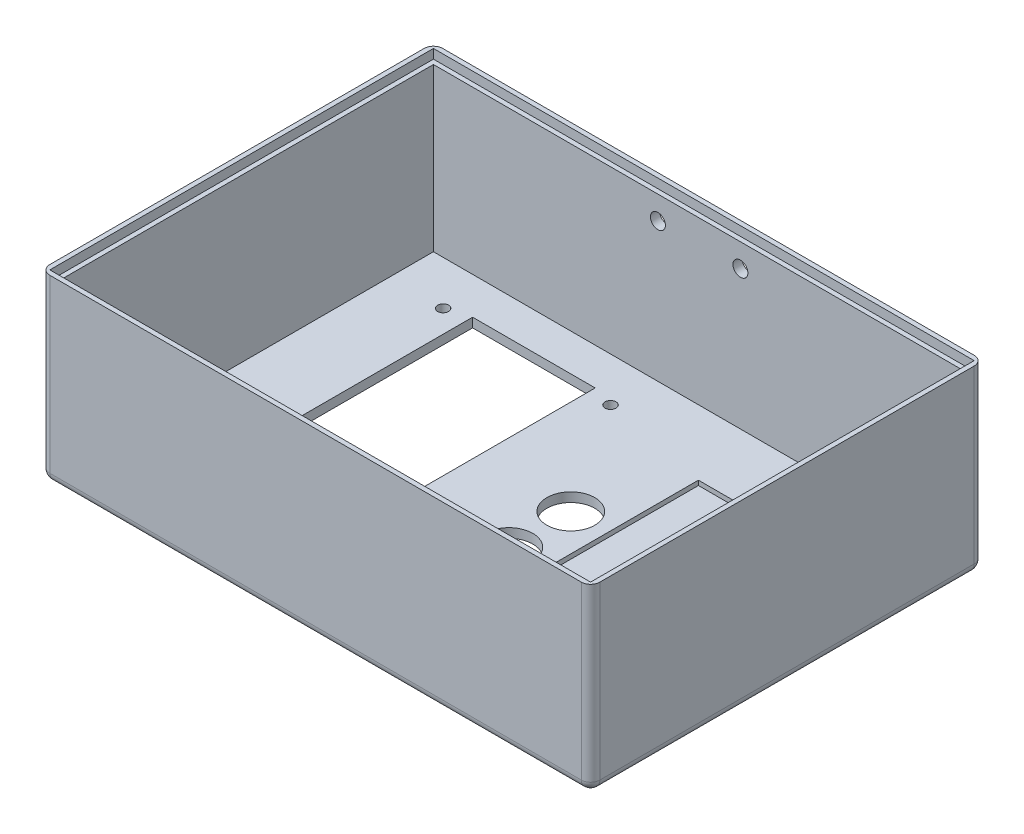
ISO-10303-21;
HEADER;
FILE_DESCRIPTION(('STEP AP214'),'2;1');
FILE_NAME('part.step','',(''),(''),'','','');
FILE_SCHEMA(('AUTOMOTIVE_DESIGN { 1 0 10303 214 1 1 1 1 }'));
ENDSEC;
DATA;
#1=APPLICATION_CONTEXT('core data for automotive mechanical design processes');
#2=APPLICATION_PROTOCOL_DEFINITION('international standard','automotive_design',2000,#1);
#3=PRODUCT_CONTEXT('',#1,'mechanical');
#4=PRODUCT('Part','Part','',(#3));
#5=PRODUCT_RELATED_PRODUCT_CATEGORY('part','',(#4));
#6=PRODUCT_DEFINITION_FORMATION('','',#4);
#7=PRODUCT_DEFINITION_CONTEXT('part definition',#1,'design');
#8=PRODUCT_DEFINITION('design','',#6,#7);
#9=PRODUCT_DEFINITION_SHAPE('','',#8);
#10=(LENGTH_UNIT() NAMED_UNIT(*) SI_UNIT(.MILLI.,.METRE.));
#11=(NAMED_UNIT(*) PLANE_ANGLE_UNIT() SI_UNIT($,.RADIAN.));
#12=(NAMED_UNIT(*) SI_UNIT($,.STERADIAN.) SOLID_ANGLE_UNIT());
#13=UNCERTAINTY_MEASURE_WITH_UNIT(LENGTH_MEASURE(1.E-05),#10,'distance_accuracy_value','');
#14=(GEOMETRIC_REPRESENTATION_CONTEXT(3) GLOBAL_UNCERTAINTY_ASSIGNED_CONTEXT((#13)) GLOBAL_UNIT_ASSIGNED_CONTEXT((#10,
#11,#12)) REPRESENTATION_CONTEXT('',''));
#15=CARTESIAN_POINT('',(0.,0.,0.));
#16=DIRECTION('',(0.,0.,1.));
#17=DIRECTION('',(1.,0.,0.));
#18=AXIS2_PLACEMENT_3D('',#15,#16,#17);
#19=CARTESIAN_POINT('',(88.9,0.,-63.5));
#20=DIRECTION('',(0.,0.,-1.));
#21=DIRECTION('',(-1.,0.,0.));
#22=AXIS2_PLACEMENT_3D('',#19,#20,#21);
#23=PLANE('',#22);
#24=CARTESIAN_POINT('',(-13.335,47.879,-63.5));
#25=DIRECTION('',(0.,0.,1.));
#26=DIRECTION('',(1.,0.,0.));
#27=AXIS2_PLACEMENT_3D('',#24,#25,#26);
#28=CIRCLE('',#27,2.413);
#29=CARTESIAN_POINT('',(-10.922,47.879,-63.5));
#30=VERTEX_POINT('',#29);
#31=EDGE_CURVE('E537',#30,#30,#28,.T.);
#32=ORIENTED_EDGE('',*,*,#31,.T.);
#33=EDGE_LOOP('',(#32));
#34=FACE_BOUND('',#33,.T.);
#35=DIRECTION('',(-1.,0.,0.));
#36=VECTOR('',#35,1.);
#37=CARTESIAN_POINT('',(-88.9,2.99999999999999,-63.5));
#38=LINE('',#37,#36);
#39=CARTESIAN_POINT('',(85.9,2.99999999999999,-63.5));
#40=VERTEX_POINT('',#39);
#41=CARTESIAN_POINT('',(-85.9,2.99999999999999,-63.5));
#42=VERTEX_POINT('',#41);
#43=EDGE_CURVE('E418',#40,#42,#38,.T.);
#44=ORIENTED_EDGE('',*,*,#43,.T.);
#45=DIRECTION('',(0.,1.,0.));
#46=VECTOR('',#45,1.);
#47=CARTESIAN_POINT('',(-85.9,0.,-63.5));
#48=LINE('',#47,#46);
#49=CARTESIAN_POINT('',(-85.9,58.42,-63.5));
#50=VERTEX_POINT('',#49);
#51=EDGE_CURVE('E424',#42,#50,#48,.T.);
#52=ORIENTED_EDGE('',*,*,#51,.T.);
#53=DIRECTION('',(-1.,0.,0.));
#54=VECTOR('',#53,1.);
#55=CARTESIAN_POINT('',(88.9,58.42,-63.5));
#56=LINE('',#55,#54);
#57=CARTESIAN_POINT('',(85.9,58.42,-63.5));
#58=VERTEX_POINT('',#57);
#59=EDGE_CURVE('E414',#58,#50,#56,.T.);
#60=ORIENTED_EDGE('',*,*,#59,.F.);
#61=DIRECTION('',(0.,1.,0.));
#62=VECTOR('',#61,1.);
#63=CARTESIAN_POINT('',(85.9,0.,-63.5));
#64=LINE('',#63,#62);
#65=EDGE_CURVE('E421',#58,#40,#64,.F.);
#66=ORIENTED_EDGE('',*,*,#65,.T.);
#67=EDGE_LOOP('',(#44,#52,#60,#66));
#68=FACE_BOUND('',#67,.T.);
#69=CARTESIAN_POINT('',(13.335,47.879,-63.5));
#70=DIRECTION('',(0.,0.,-1.));
#71=DIRECTION('',(-1.,0.,0.));
#72=AXIS2_PLACEMENT_3D('',#69,#70,#71);
#73=CIRCLE('',#72,2.413);
#74=CARTESIAN_POINT('',(10.922,47.879,-63.5));
#75=VERTEX_POINT('',#74);
#76=EDGE_CURVE('E698',#75,#75,#73,.T.);
#77=ORIENTED_EDGE('',*,*,#76,.F.);
#78=EDGE_LOOP('',(#77));
#79=FACE_BOUND('',#78,.T.);
#80=ADVANCED_FACE('F39',(#34,#68,#79),#23,.T.);
#81=CARTESIAN_POINT('',(85.9,3.,-60.5));
#82=DIRECTION('',(0.,0.,-1.));
#83=DIRECTION('',(-1.,0.,0.));
#84=AXIS2_PLACEMENT_3D('',#81,#82,#83);
#85=PLANE('',#84);
#86=DIRECTION('',(-1.,0.,0.));
#87=VECTOR('',#86,1.);
#88=CARTESIAN_POINT('',(85.9,55.42,-60.5));
#89=LINE('',#88,#87);
#90=CARTESIAN_POINT('',(85.9,55.42,-60.5));
#91=VERTEX_POINT('',#90);
#92=CARTESIAN_POINT('',(-85.9,55.42,-60.5));
#93=VERTEX_POINT('',#92);
#94=EDGE_CURVE('E320',#91,#93,#89,.T.);
#95=ORIENTED_EDGE('',*,*,#94,.T.);
#96=DIRECTION('',(0.,1.,0.));
#97=VECTOR('',#96,1.);
#98=CARTESIAN_POINT('',(-85.9,3.,-60.5));
#99=LINE('',#98,#97);
#100=CARTESIAN_POINT('',(-85.9,3.,-60.5));
#101=VERTEX_POINT('',#100);
#102=EDGE_CURVE('E346',#101,#93,#99,.T.);
#103=ORIENTED_EDGE('',*,*,#102,.F.);
#104=DIRECTION('',(-1.,0.,0.));
#105=VECTOR('',#104,1.);
#106=CARTESIAN_POINT('',(85.9,3.,-60.5));
#107=LINE('',#106,#105);
#108=CARTESIAN_POINT('',(85.9,3.,-60.5));
#109=VERTEX_POINT('',#108);
#110=EDGE_CURVE('E328',#109,#101,#107,.T.);
#111=ORIENTED_EDGE('',*,*,#110,.F.);
#112=DIRECTION('',(0.,1.,0.));
#113=VECTOR('',#112,1.);
#114=CARTESIAN_POINT('',(85.9,3.,-60.5));
#115=LINE('',#114,#113);
#116=EDGE_CURVE('E350',#109,#91,#115,.T.);
#117=ORIENTED_EDGE('',*,*,#116,.T.);
#118=EDGE_LOOP('',(#95,#103,#111,#117));
#119=FACE_BOUND('',#118,.T.);
#120=CARTESIAN_POINT('',(-13.335,47.879,-60.5));
#121=DIRECTION('',(0.,0.,-1.));
#122=DIRECTION('',(-1.,0.,0.));
#123=AXIS2_PLACEMENT_3D('',#120,#121,#122);
#124=CIRCLE('',#123,2.413);
#125=CARTESIAN_POINT('',(-15.748,47.879,-60.5));
#126=VERTEX_POINT('',#125);
#127=EDGE_CURVE('E706',#126,#126,#124,.T.);
#128=ORIENTED_EDGE('',*,*,#127,.T.);
#129=EDGE_LOOP('',(#128));
#130=FACE_BOUND('',#129,.T.);
#131=CARTESIAN_POINT('',(13.335,47.879,-60.5));
#132=DIRECTION('',(0.,0.,-1.));
#133=DIRECTION('',(-1.,0.,0.));
#134=AXIS2_PLACEMENT_3D('',#131,#132,#133);
#135=CIRCLE('',#134,2.413);
#136=CARTESIAN_POINT('',(10.922,47.879,-60.5));
#137=VERTEX_POINT('',#136);
#138=EDGE_CURVE('E480',#137,#137,#135,.F.);
#139=ORIENTED_EDGE('',*,*,#138,.F.);
#140=EDGE_LOOP('',(#139));
#141=FACE_BOUND('',#140,.T.);
#142=ADVANCED_FACE('F595',(#119,#130,#141),#85,.F.);
#143=CARTESIAN_POINT('',(-88.9,0.,-63.5));
#144=DIRECTION('',(-1.,0.,0.));
#145=DIRECTION('',(0.,0.,1.));
#146=AXIS2_PLACEMENT_3D('',#143,#144,#145);
#147=PLANE('',#146);
#148=DIRECTION('',(0.,0.,1.));
#149=VECTOR('',#148,1.);
#150=CARTESIAN_POINT('',(-88.9,58.42,-63.5));
#151=LINE('',#150,#149);
#152=CARTESIAN_POINT('',(-88.9,58.42,-60.5));
#153=VERTEX_POINT('',#152);
#154=CARTESIAN_POINT('',(-88.9,58.42,60.5));
#155=VERTEX_POINT('',#154);
#156=EDGE_CURVE('E393',#153,#155,#151,.T.);
#157=ORIENTED_EDGE('',*,*,#156,.F.);
#158=DIRECTION('',(0.,1.,0.));
#159=VECTOR('',#158,1.);
#160=CARTESIAN_POINT('',(-88.9,0.,-60.5));
#161=LINE('',#160,#159);
#162=CARTESIAN_POINT('',(-88.9,2.99999999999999,-60.5));
#163=VERTEX_POINT('',#162);
#164=EDGE_CURVE('E446',#153,#163,#161,.F.);
#165=ORIENTED_EDGE('',*,*,#164,.T.);
#166=DIRECTION('',(0.,0.,1.));
#167=VECTOR('',#166,1.);
#168=CARTESIAN_POINT('',(-88.9,2.99999999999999,63.5));
#169=LINE('',#168,#167);
#170=CARTESIAN_POINT('',(-88.9,2.99999999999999,60.5));
#171=VERTEX_POINT('',#170);
#172=EDGE_CURVE('E440',#163,#171,#169,.T.);
#173=ORIENTED_EDGE('',*,*,#172,.T.);
#174=DIRECTION('',(0.,1.,0.));
#175=VECTOR('',#174,1.);
#176=CARTESIAN_POINT('',(-88.9,0.,60.5));
#177=LINE('',#176,#175);
#178=EDGE_CURVE('E443',#171,#155,#177,.T.);
#179=ORIENTED_EDGE('',*,*,#178,.T.);
#180=EDGE_LOOP('',(#157,#165,#173,#179));
#181=FACE_BOUND('',#180,.T.);
#182=ADVANCED_FACE('F601',(#181),#147,.T.);
#183=CARTESIAN_POINT('',(88.9,0.,63.5));
#184=DIRECTION('',(1.,0.,0.));
#185=DIRECTION('',(0.,0.,-1.));
#186=AXIS2_PLACEMENT_3D('',#183,#184,#185);
#187=PLANE('',#186);
#188=DIRECTION('',(0.,0.,-1.));
#189=VECTOR('',#188,1.);
#190=CARTESIAN_POINT('',(88.9,2.99999999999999,-63.5));
#191=LINE('',#190,#189);
#192=CARTESIAN_POINT('',(88.9,2.99999999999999,60.5));
#193=VERTEX_POINT('',#192);
#194=CARTESIAN_POINT('',(88.9,2.99999999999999,-60.5));
#195=VERTEX_POINT('',#194);
#196=EDGE_CURVE('E49',#193,#195,#191,.T.);
#197=ORIENTED_EDGE('',*,*,#196,.T.);
#198=DIRECTION('',(0.,1.,0.));
#199=VECTOR('',#198,1.);
#200=CARTESIAN_POINT('',(88.9,0.,-60.5));
#201=LINE('',#200,#199);
#202=CARTESIAN_POINT('',(88.9,58.42,-60.5));
#203=VERTEX_POINT('',#202);
#204=EDGE_CURVE('E11',#195,#203,#201,.T.);
#205=ORIENTED_EDGE('',*,*,#204,.T.);
#206=DIRECTION('',(0.,0.,-1.));
#207=VECTOR('',#206,1.);
#208=CARTESIAN_POINT('',(88.9,58.42,63.5));
#209=LINE('',#208,#207);
#210=CARTESIAN_POINT('',(88.9,58.42,60.5));
#211=VERTEX_POINT('',#210);
#212=EDGE_CURVE('E410',#211,#203,#209,.T.);
#213=ORIENTED_EDGE('',*,*,#212,.F.);
#214=DIRECTION('',(0.,1.,0.));
#215=VECTOR('',#214,1.);
#216=CARTESIAN_POINT('',(88.9,0.,60.5));
#217=LINE('',#216,#215);
#218=EDGE_CURVE('E60',#211,#193,#217,.F.);
#219=ORIENTED_EDGE('',*,*,#218,.T.);
#220=EDGE_LOOP('',(#197,#205,#213,#219));
#221=FACE_BOUND('',#220,.T.);
#222=ADVANCED_FACE('F610',(#221),#187,.T.);
#223=CARTESIAN_POINT('',(-88.9,0.,63.5));
#224=DIRECTION('',(0.,0.,1.));
#225=DIRECTION('',(1.,0.,0.));
#226=AXIS2_PLACEMENT_3D('',#223,#224,#225);
#227=PLANE('',#226);
#228=DIRECTION('',(1.,0.,0.));
#229=VECTOR('',#228,1.);
#230=CARTESIAN_POINT('',(-88.9,58.42,63.5));
#231=LINE('',#230,#229);
#232=CARTESIAN_POINT('',(-85.9,58.42,63.5));
#233=VERTEX_POINT('',#232);
#234=CARTESIAN_POINT('',(85.9,58.42,63.5));
#235=VERTEX_POINT('',#234);
#236=EDGE_CURVE('E406',#233,#235,#231,.T.);
#237=ORIENTED_EDGE('',*,*,#236,.F.);
#238=DIRECTION('',(0.,1.,0.));
#239=VECTOR('',#238,1.);
#240=CARTESIAN_POINT('',(-85.9,0.,63.5));
#241=LINE('',#240,#239);
#242=CARTESIAN_POINT('',(-85.9,2.99999999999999,63.5));
#243=VERTEX_POINT('',#242);
#244=EDGE_CURVE('E455',#233,#243,#241,.F.);
#245=ORIENTED_EDGE('',*,*,#244,.T.);
#246=DIRECTION('',(1.,0.,0.));
#247=VECTOR('',#246,1.);
#248=CARTESIAN_POINT('',(88.9,2.99999999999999,63.5));
#249=LINE('',#248,#247);
#250=CARTESIAN_POINT('',(85.9,2.99999999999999,63.5));
#251=VERTEX_POINT('',#250);
#252=EDGE_CURVE('E452',#243,#251,#249,.T.);
#253=ORIENTED_EDGE('',*,*,#252,.T.);
#254=DIRECTION('',(0.,1.,0.));
#255=VECTOR('',#254,1.);
#256=CARTESIAN_POINT('',(85.9,0.,63.5));
#257=LINE('',#256,#255);
#258=EDGE_CURVE('E449',#251,#235,#257,.T.);
#259=ORIENTED_EDGE('',*,*,#258,.T.);
#260=EDGE_LOOP('',(#237,#245,#253,#259));
#261=FACE_BOUND('',#260,.T.);
#262=ADVANCED_FACE('F613',(#261),#227,.T.);
#263=CARTESIAN_POINT('',(0.,0.,0.));
#264=DIRECTION('',(0.,1.,0.));
#265=DIRECTION('',(0.,0.,1.));
#266=AXIS2_PLACEMENT_3D('',#263,#264,#265);
#267=PLANE('',#266);
#268=DIRECTION('',(1.,0.,0.));
#269=VECTOR('',#268,1.);
#270=CARTESIAN_POINT('',(-88.9,0.,60.5));
#271=LINE('',#270,#269);
#272=CARTESIAN_POINT('',(85.9,0.,60.5));
#273=VERTEX_POINT('',#272);
#274=CARTESIAN_POINT('',(-85.9,0.,60.5));
#275=VERTEX_POINT('',#274);
#276=EDGE_CURVE('E461',#273,#275,#271,.F.);
#277=ORIENTED_EDGE('',*,*,#276,.T.);
#278=DIRECTION('',(0.,0.,1.));
#279=VECTOR('',#278,1.);
#280=CARTESIAN_POINT('',(-85.9,0.,-63.5));
#281=LINE('',#280,#279);
#282=CARTESIAN_POINT('',(-85.9,0.,-60.5));
#283=VERTEX_POINT('',#282);
#284=EDGE_CURVE('E467',#275,#283,#281,.F.);
#285=ORIENTED_EDGE('',*,*,#284,.T.);
#286=DIRECTION('',(-1.,0.,0.));
#287=VECTOR('',#286,1.);
#288=CARTESIAN_POINT('',(88.9,0.,-60.5));
#289=LINE('',#288,#287);
#290=CARTESIAN_POINT('',(85.9,0.,-60.5));
#291=VERTEX_POINT('',#290);
#292=EDGE_CURVE('E464',#283,#291,#289,.F.);
#293=ORIENTED_EDGE('',*,*,#292,.T.);
#294=DIRECTION('',(0.,0.,-1.));
#295=VECTOR('',#294,1.);
#296=CARTESIAN_POINT('',(85.9,0.,63.5));
#297=LINE('',#296,#295);
#298=EDGE_CURVE('E458',#291,#273,#297,.F.);
#299=ORIENTED_EDGE('',*,*,#298,.T.);
#300=EDGE_LOOP('',(#277,#285,#293,#299));
#301=FACE_BOUND('',#300,.T.);
#302=CARTESIAN_POINT('',(-68.487,0.,-46.228));
#303=DIRECTION('',(0.,1.,0.));
#304=DIRECTION('',(0.,0.,1.));
#305=AXIS2_PLACEMENT_3D('',#302,#303,#304);
#306=CIRCLE('',#305,1.77799999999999);
#307=CARTESIAN_POINT('',(-68.487,0.,-44.45));
#308=VERTEX_POINT('',#307);
#309=EDGE_CURVE('E528',#308,#308,#306,.T.);
#310=ORIENTED_EDGE('',*,*,#309,.T.);
#311=EDGE_LOOP('',(#310));
#312=FACE_BOUND('',#311,.T.);
#313=CARTESIAN_POINT('',(-68.487,0.,46.228));
#314=DIRECTION('',(0.,1.,0.));
#315=DIRECTION('',(0.,0.,1.));
#316=AXIS2_PLACEMENT_3D('',#313,#314,#315);
#317=CIRCLE('',#316,1.77799999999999);
#318=CARTESIAN_POINT('',(-68.487,0.,48.006));
#319=VERTEX_POINT('',#318);
#320=EDGE_CURVE('E543',#319,#319,#317,.T.);
#321=ORIENTED_EDGE('',*,*,#320,.T.);
#322=EDGE_LOOP('',(#321));
#323=FACE_BOUND('',#322,.T.);
#324=CARTESIAN_POINT('',(-14.385,0.,46.228));
#325=DIRECTION('',(0.,1.,0.));
#326=DIRECTION('',(0.,0.,1.));
#327=AXIS2_PLACEMENT_3D('',#324,#325,#326);
#328=CIRCLE('',#327,1.77799999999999);
#329=CARTESIAN_POINT('',(-14.385,0.,48.006));
#330=VERTEX_POINT('',#329);
#331=EDGE_CURVE('E551',#330,#330,#328,.T.);
#332=ORIENTED_EDGE('',*,*,#331,.T.);
#333=EDGE_LOOP('',(#332));
#334=FACE_BOUND('',#333,.T.);
#335=CARTESIAN_POINT('',(-14.385,0.,-46.228));
#336=DIRECTION('',(0.,1.,0.));
#337=DIRECTION('',(0.,0.,1.));
#338=AXIS2_PLACEMENT_3D('',#335,#336,#337);
#339=CIRCLE('',#338,1.77799999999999);
#340=CARTESIAN_POINT('',(-14.385,0.,-44.45));
#341=VERTEX_POINT('',#340);
#342=EDGE_CURVE('E559',#341,#341,#339,.T.);
#343=ORIENTED_EDGE('',*,*,#342,.T.);
#344=EDGE_LOOP('',(#343));
#345=FACE_BOUND('',#344,.T.);
#346=CARTESIAN_POINT('',(8.99245590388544,0.,10.0167592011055));
#347=DIRECTION('',(0.,1.,0.));
#348=DIRECTION('',(0.,0.,1.));
#349=AXIS2_PLACEMENT_3D('',#346,#347,#348);
#350=CIRCLE('',#349,7.74699999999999);
#351=CARTESIAN_POINT('',(8.99245590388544,0.,17.7637592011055));
#352=VERTEX_POINT('',#351);
#353=EDGE_CURVE('E567',#352,#352,#350,.T.);
#354=ORIENTED_EDGE('',*,*,#353,.T.);
#355=EDGE_LOOP('',(#354));
#356=FACE_BOUND('',#355,.T.);
#357=CARTESIAN_POINT('',(8.99245590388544,0.,-10.0167592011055));
#358=DIRECTION('',(0.,1.,0.));
#359=DIRECTION('',(0.,0.,1.));
#360=AXIS2_PLACEMENT_3D('',#357,#358,#359);
#361=CIRCLE('',#360,7.74699999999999);
#362=CARTESIAN_POINT('',(8.99245590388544,0.,-2.26975920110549));
#363=VERTEX_POINT('',#362);
#364=EDGE_CURVE('E247',#363,#363,#361,.T.);
#365=ORIENTED_EDGE('',*,*,#364,.T.);
#366=EDGE_LOOP('',(#365));
#367=FACE_BOUND('',#366,.T.);
#368=DIRECTION('',(1.,0.,0.));
#369=VECTOR('',#368,1.);
#370=CARTESIAN_POINT('',(-61.248,0.,48.514));
#371=LINE('',#370,#369);
#372=CARTESIAN_POINT('',(-61.248,0.,48.514));
#373=VERTEX_POINT('',#372);
#374=CARTESIAN_POINT('',(-21.624,0.,48.514));
#375=VERTEX_POINT('',#374);
#376=EDGE_CURVE('E284',#373,#375,#371,.T.);
#377=ORIENTED_EDGE('',*,*,#376,.T.);
#378=DIRECTION('',(0.,0.,-1.));
#379=VECTOR('',#378,1.);
#380=CARTESIAN_POINT('',(-21.624,0.,48.514));
#381=LINE('',#380,#379);
#382=CARTESIAN_POINT('',(-21.624,0.,-48.514));
#383=VERTEX_POINT('',#382);
#384=EDGE_CURVE('E271',#375,#383,#381,.T.);
#385=ORIENTED_EDGE('',*,*,#384,.T.);
#386=DIRECTION('',(-1.,0.,0.));
#387=VECTOR('',#386,1.);
#388=CARTESIAN_POINT('',(-21.624,0.,-48.514));
#389=LINE('',#388,#387);
#390=CARTESIAN_POINT('',(-61.248,0.,-48.514));
#391=VERTEX_POINT('',#390);
#392=EDGE_CURVE('E275',#383,#391,#389,.T.);
#393=ORIENTED_EDGE('',*,*,#392,.T.);
#394=DIRECTION('',(0.,0.,1.));
#395=VECTOR('',#394,1.);
#396=CARTESIAN_POINT('',(-61.248,0.,-48.514));
#397=LINE('',#396,#395);
#398=EDGE_CURVE('E280',#391,#373,#397,.T.);
#399=ORIENTED_EDGE('',*,*,#398,.T.);
#400=EDGE_LOOP('',(#377,#385,#393,#399));
#401=FACE_BOUND('',#400,.T.);
#402=ADVANCED_FACE('F579',(#301,#312,#323,#334,#345,#356,#367,#401),#267,.F.);
#403=CARTESIAN_POINT('',(0.,58.42,0.));
#404=DIRECTION('',(0.,1.,0.));
#405=DIRECTION('',(0.,0.,1.));
#406=AXIS2_PLACEMENT_3D('',#403,#404,#405);
#407=PLANE('',#406);
#408=DIRECTION('',(0.,0.,1.));
#409=VECTOR('',#408,1.);
#410=CARTESIAN_POINT('',(-87.4,58.42,-62.));
#411=LINE('',#410,#409);
#412=CARTESIAN_POINT('',(-87.4,58.42,-62.));
#413=VERTEX_POINT('',#412);
#414=CARTESIAN_POINT('',(-87.4,58.42,62.));
#415=VERTEX_POINT('',#414);
#416=EDGE_CURVE('E349',#413,#415,#411,.T.);
#417=ORIENTED_EDGE('',*,*,#416,.F.);
#418=DIRECTION('',(-1.,0.,0.));
#419=VECTOR('',#418,1.);
#420=CARTESIAN_POINT('',(87.4,58.42,-62.));
#421=LINE('',#420,#419);
#422=CARTESIAN_POINT('',(87.4,58.42,-62.));
#423=VERTEX_POINT('',#422);
#424=EDGE_CURVE('E364',#423,#413,#421,.T.);
#425=ORIENTED_EDGE('',*,*,#424,.F.);
#426=DIRECTION('',(0.,0.,-1.));
#427=VECTOR('',#426,1.);
#428=CARTESIAN_POINT('',(87.4,58.42,62.));
#429=LINE('',#428,#427);
#430=CARTESIAN_POINT('',(87.4,58.42,62.));
#431=VERTEX_POINT('',#430);
#432=EDGE_CURVE('E383',#431,#423,#429,.T.);
#433=ORIENTED_EDGE('',*,*,#432,.F.);
#434=DIRECTION('',(1.,0.,0.));
#435=VECTOR('',#434,1.);
#436=CARTESIAN_POINT('',(-87.4,58.42,62.));
#437=LINE('',#436,#435);
#438=EDGE_CURVE('E379',#415,#431,#437,.T.);
#439=ORIENTED_EDGE('',*,*,#438,.F.);
#440=EDGE_LOOP('',(#417,#425,#433,#439));
#441=FACE_BOUND('',#440,.T.);
#442=ORIENTED_EDGE('',*,*,#59,.T.);
#443=CARTESIAN_POINT('',(-85.9,58.42,-60.5));
#444=DIRECTION('',(0.,1.,0.));
#445=DIRECTION('',(0.,0.,1.));
#446=AXIS2_PLACEMENT_3D('',#443,#444,#445);
#447=CIRCLE('',#446,3.);
#448=EDGE_CURVE('E437',#50,#153,#447,.T.);
#449=ORIENTED_EDGE('',*,*,#448,.T.);
#450=ORIENTED_EDGE('',*,*,#156,.T.);
#451=CARTESIAN_POINT('',(-85.9,58.42,60.5));
#452=DIRECTION('',(0.,1.,0.));
#453=DIRECTION('',(0.,0.,1.));
#454=AXIS2_PLACEMENT_3D('',#451,#452,#453);
#455=CIRCLE('',#454,3.);
#456=EDGE_CURVE('E434',#155,#233,#455,.T.);
#457=ORIENTED_EDGE('',*,*,#456,.T.);
#458=ORIENTED_EDGE('',*,*,#236,.T.);
#459=CARTESIAN_POINT('',(85.9,58.42,60.5));
#460=DIRECTION('',(0.,1.,0.));
#461=DIRECTION('',(0.,0.,1.));
#462=AXIS2_PLACEMENT_3D('',#459,#460,#461);
#463=CIRCLE('',#462,3.);
#464=EDGE_CURVE('E428',#235,#211,#463,.T.);
#465=ORIENTED_EDGE('',*,*,#464,.T.);
#466=ORIENTED_EDGE('',*,*,#212,.T.);
#467=CARTESIAN_POINT('',(85.9,58.42,-60.5));
#468=DIRECTION('',(0.,1.,0.));
#469=DIRECTION('',(0.,0.,1.));
#470=AXIS2_PLACEMENT_3D('',#467,#468,#469);
#471=CIRCLE('',#470,3.);
#472=EDGE_CURVE('E431',#203,#58,#471,.T.);
#473=ORIENTED_EDGE('',*,*,#472,.T.);
#474=EDGE_LOOP('',(#442,#449,#450,#457,#458,#465,#466,#473));
#475=FACE_BOUND('',#474,.T.);
#476=ADVANCED_FACE('F608',(#441,#475),#407,.T.);
#477=CARTESIAN_POINT('',(-87.4,55.42,-62.));
#478=DIRECTION('',(-1.,0.,0.));
#479=DIRECTION('',(0.,0.,1.));
#480=AXIS2_PLACEMENT_3D('',#477,#478,#479);
#481=PLANE('',#480);
#482=ORIENTED_EDGE('',*,*,#416,.T.);
#483=DIRECTION('',(0.,1.,0.));
#484=VECTOR('',#483,1.);
#485=CARTESIAN_POINT('',(-87.4,55.42,62.));
#486=LINE('',#485,#484);
#487=CARTESIAN_POINT('',(-87.4,55.42,62.));
#488=VERTEX_POINT('',#487);
#489=EDGE_CURVE('E376',#488,#415,#486,.T.);
#490=ORIENTED_EDGE('',*,*,#489,.F.);
#491=DIRECTION('',(0.,0.,1.));
#492=VECTOR('',#491,1.);
#493=CARTESIAN_POINT('',(-87.4,55.42,-62.));
#494=LINE('',#493,#492);
#495=CARTESIAN_POINT('',(-87.4,55.42,-62.));
#496=VERTEX_POINT('',#495);
#497=EDGE_CURVE('E359',#496,#488,#494,.T.);
#498=ORIENTED_EDGE('',*,*,#497,.F.);
#499=DIRECTION('',(0.,1.,0.));
#500=VECTOR('',#499,1.);
#501=CARTESIAN_POINT('',(-87.4,55.42,-62.));
#502=LINE('',#501,#500);
#503=EDGE_CURVE('E390',#496,#413,#502,.T.);
#504=ORIENTED_EDGE('',*,*,#503,.T.);
#505=EDGE_LOOP('',(#482,#490,#498,#504));
#506=FACE_BOUND('',#505,.T.);
#507=ADVANCED_FACE('F782',(#506),#481,.F.);
#508=CARTESIAN_POINT('',(87.4,55.42,-62.));
#509=DIRECTION('',(0.,0.,-1.));
#510=DIRECTION('',(-1.,0.,0.));
#511=AXIS2_PLACEMENT_3D('',#508,#509,#510);
#512=PLANE('',#511);
#513=ORIENTED_EDGE('',*,*,#424,.T.);
#514=ORIENTED_EDGE('',*,*,#503,.F.);
#515=DIRECTION('',(-1.,0.,0.));
#516=VECTOR('',#515,1.);
#517=CARTESIAN_POINT('',(87.4,55.42,-62.));
#518=LINE('',#517,#516);
#519=CARTESIAN_POINT('',(87.4,55.42,-62.));
#520=VERTEX_POINT('',#519);
#521=EDGE_CURVE('E372',#520,#496,#518,.T.);
#522=ORIENTED_EDGE('',*,*,#521,.F.);
#523=DIRECTION('',(0.,1.,0.));
#524=VECTOR('',#523,1.);
#525=CARTESIAN_POINT('',(87.4,55.42,-62.));
#526=LINE('',#525,#524);
#527=EDGE_CURVE('E394',#520,#423,#526,.T.);
#528=ORIENTED_EDGE('',*,*,#527,.T.);
#529=EDGE_LOOP('',(#513,#514,#522,#528));
#530=FACE_BOUND('',#529,.T.);
#531=ADVANCED_FACE('F791',(#530),#512,.F.);
#532=CARTESIAN_POINT('',(87.4,55.42,62.));
#533=DIRECTION('',(1.,0.,0.));
#534=DIRECTION('',(0.,0.,-1.));
#535=AXIS2_PLACEMENT_3D('',#532,#533,#534);
#536=PLANE('',#535);
#537=ORIENTED_EDGE('',*,*,#432,.T.);
#538=ORIENTED_EDGE('',*,*,#527,.F.);
#539=DIRECTION('',(0.,0.,-1.));
#540=VECTOR('',#539,1.);
#541=CARTESIAN_POINT('',(87.4,55.42,62.));
#542=LINE('',#541,#540);
#543=CARTESIAN_POINT('',(87.4,55.42,62.));
#544=VERTEX_POINT('',#543);
#545=EDGE_CURVE('E368',#544,#520,#542,.T.);
#546=ORIENTED_EDGE('',*,*,#545,.F.);
#547=DIRECTION('',(0.,1.,0.));
#548=VECTOR('',#547,1.);
#549=CARTESIAN_POINT('',(87.4,55.42,62.));
#550=LINE('',#549,#548);
#551=EDGE_CURVE('E397',#544,#431,#550,.T.);
#552=ORIENTED_EDGE('',*,*,#551,.T.);
#553=EDGE_LOOP('',(#537,#538,#546,#552));
#554=FACE_BOUND('',#553,.T.);
#555=ADVANCED_FACE('F789',(#554),#536,.F.);
#556=CARTESIAN_POINT('',(-87.4,55.42,62.));
#557=DIRECTION('',(0.,0.,1.));
#558=DIRECTION('',(1.,0.,0.));
#559=AXIS2_PLACEMENT_3D('',#556,#557,#558);
#560=PLANE('',#559);
#561=ORIENTED_EDGE('',*,*,#438,.T.);
#562=ORIENTED_EDGE('',*,*,#551,.F.);
#563=DIRECTION('',(1.,0.,0.));
#564=VECTOR('',#563,1.);
#565=CARTESIAN_POINT('',(-87.4,55.42,62.));
#566=LINE('',#565,#564);
#567=EDGE_CURVE('E363',#488,#544,#566,.T.);
#568=ORIENTED_EDGE('',*,*,#567,.F.);
#569=ORIENTED_EDGE('',*,*,#489,.T.);
#570=EDGE_LOOP('',(#561,#562,#568,#569));
#571=FACE_BOUND('',#570,.T.);
#572=ADVANCED_FACE('F776',(#571),#560,.F.);
#573=CARTESIAN_POINT('',(0.,55.42,0.));
#574=DIRECTION('',(0.,1.,0.));
#575=DIRECTION('',(0.,0.,1.));
#576=AXIS2_PLACEMENT_3D('',#573,#574,#575);
#577=PLANE('',#576);
#578=DIRECTION('',(0.,0.,1.));
#579=VECTOR('',#578,1.);
#580=CARTESIAN_POINT('',(-85.9,55.42,-60.5));
#581=LINE('',#580,#579);
#582=CARTESIAN_POINT('',(-85.9,55.42,60.5));
#583=VERTEX_POINT('',#582);
#584=EDGE_CURVE('E305',#93,#583,#581,.T.);
#585=ORIENTED_EDGE('',*,*,#584,.F.);
#586=ORIENTED_EDGE('',*,*,#94,.F.);
#587=DIRECTION('',(0.,0.,-1.));
#588=VECTOR('',#587,1.);
#589=CARTESIAN_POINT('',(85.9,55.42,60.5));
#590=LINE('',#589,#588);
#591=CARTESIAN_POINT('',(85.9,55.42,60.5));
#592=VERTEX_POINT('',#591);
#593=EDGE_CURVE('E340',#592,#91,#590,.T.);
#594=ORIENTED_EDGE('',*,*,#593,.F.);
#595=DIRECTION('',(1.,0.,0.));
#596=VECTOR('',#595,1.);
#597=CARTESIAN_POINT('',(-85.9,55.42,60.5));
#598=LINE('',#597,#596);
#599=EDGE_CURVE('E336',#583,#592,#598,.T.);
#600=ORIENTED_EDGE('',*,*,#599,.F.);
#601=EDGE_LOOP('',(#585,#586,#594,#600));
#602=FACE_BOUND('',#601,.T.);
#603=ORIENTED_EDGE('',*,*,#497,.T.);
#604=ORIENTED_EDGE('',*,*,#567,.T.);
#605=ORIENTED_EDGE('',*,*,#545,.T.);
#606=ORIENTED_EDGE('',*,*,#521,.T.);
#607=EDGE_LOOP('',(#603,#604,#605,#606));
#608=FACE_BOUND('',#607,.T.);
#609=ADVANCED_FACE('F773',(#602,#608),#577,.T.);
#610=CARTESIAN_POINT('',(-85.9,3.,-60.5));
#611=DIRECTION('',(-1.,0.,0.));
#612=DIRECTION('',(0.,0.,1.));
#613=AXIS2_PLACEMENT_3D('',#610,#611,#612);
#614=PLANE('',#613);
#615=ORIENTED_EDGE('',*,*,#584,.T.);
#616=DIRECTION('',(0.,1.,0.));
#617=VECTOR('',#616,1.);
#618=CARTESIAN_POINT('',(-85.9,3.,60.5));
#619=LINE('',#618,#617);
#620=CARTESIAN_POINT('',(-85.9,3.,60.5));
#621=VERTEX_POINT('',#620);
#622=EDGE_CURVE('E332',#621,#583,#619,.T.);
#623=ORIENTED_EDGE('',*,*,#622,.F.);
#624=DIRECTION('',(0.,0.,1.));
#625=VECTOR('',#624,1.);
#626=CARTESIAN_POINT('',(-85.9,3.,-60.5));
#627=LINE('',#626,#625);
#628=EDGE_CURVE('E315',#101,#621,#627,.T.);
#629=ORIENTED_EDGE('',*,*,#628,.F.);
#630=ORIENTED_EDGE('',*,*,#102,.T.);
#631=EDGE_LOOP('',(#615,#623,#629,#630));
#632=FACE_BOUND('',#631,.T.);
#633=ADVANCED_FACE('F763',(#632),#614,.F.);
#634=CARTESIAN_POINT('',(85.9,3.,60.5));
#635=DIRECTION('',(1.,0.,0.));
#636=DIRECTION('',(0.,0.,-1.));
#637=AXIS2_PLACEMENT_3D('',#634,#635,#636);
#638=PLANE('',#637);
#639=ORIENTED_EDGE('',*,*,#593,.T.);
#640=ORIENTED_EDGE('',*,*,#116,.F.);
#641=DIRECTION('',(0.,0.,-1.));
#642=VECTOR('',#641,1.);
#643=CARTESIAN_POINT('',(85.9,3.,60.5));
#644=LINE('',#643,#642);
#645=CARTESIAN_POINT('',(85.9,3.,60.5));
#646=VERTEX_POINT('',#645);
#647=EDGE_CURVE('E324',#646,#109,#644,.T.);
#648=ORIENTED_EDGE('',*,*,#647,.F.);
#649=DIRECTION('',(0.,1.,0.));
#650=VECTOR('',#649,1.);
#651=CARTESIAN_POINT('',(85.9,3.,60.5));
#652=LINE('',#651,#650);
#653=EDGE_CURVE('E354',#646,#592,#652,.T.);
#654=ORIENTED_EDGE('',*,*,#653,.T.);
#655=EDGE_LOOP('',(#639,#640,#648,#654));
#656=FACE_BOUND('',#655,.T.);
#657=ADVANCED_FACE('F770',(#656),#638,.F.);
#658=CARTESIAN_POINT('',(-85.9,3.,60.5));
#659=DIRECTION('',(0.,0.,1.));
#660=DIRECTION('',(1.,0.,0.));
#661=AXIS2_PLACEMENT_3D('',#658,#659,#660);
#662=PLANE('',#661);
#663=ORIENTED_EDGE('',*,*,#599,.T.);
#664=ORIENTED_EDGE('',*,*,#653,.F.);
#665=DIRECTION('',(1.,0.,0.));
#666=VECTOR('',#665,1.);
#667=CARTESIAN_POINT('',(-85.9,3.,60.5));
#668=LINE('',#667,#666);
#669=EDGE_CURVE('E319',#621,#646,#668,.T.);
#670=ORIENTED_EDGE('',*,*,#669,.F.);
#671=ORIENTED_EDGE('',*,*,#622,.T.);
#672=EDGE_LOOP('',(#663,#664,#670,#671));
#673=FACE_BOUND('',#672,.T.);
#674=ADVANCED_FACE('F747',(#673),#662,.F.);
#675=CARTESIAN_POINT('',(0.,3.,0.));
#676=DIRECTION('',(0.,1.,0.));
#677=DIRECTION('',(0.,0.,1.));
#678=AXIS2_PLACEMENT_3D('',#675,#676,#677);
#679=PLANE('',#678);
#680=CARTESIAN_POINT('',(-68.487,3.,-46.228));
#681=DIRECTION('',(0.,1.,0.));
#682=DIRECTION('',(0.,0.,1.));
#683=AXIS2_PLACEMENT_3D('',#680,#681,#682);
#684=CIRCLE('',#683,1.77799999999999);
#685=CARTESIAN_POINT('',(-68.487,3.,-44.45));
#686=VERTEX_POINT('',#685);
#687=EDGE_CURVE('E523',#686,#686,#684,.T.);
#688=ORIENTED_EDGE('',*,*,#687,.F.);
#689=EDGE_LOOP('',(#688));
#690=FACE_BOUND('',#689,.T.);
#691=CARTESIAN_POINT('',(-68.487,3.,46.228));
#692=DIRECTION('',(0.,1.,0.));
#693=DIRECTION('',(0.,0.,1.));
#694=AXIS2_PLACEMENT_3D('',#691,#692,#693);
#695=CIRCLE('',#694,1.77799999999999);
#696=CARTESIAN_POINT('',(-68.487,3.,48.006));
#697=VERTEX_POINT('',#696);
#698=EDGE_CURVE('E534',#697,#697,#695,.T.);
#699=ORIENTED_EDGE('',*,*,#698,.F.);
#700=EDGE_LOOP('',(#699));
#701=FACE_BOUND('',#700,.T.);
#702=CARTESIAN_POINT('',(-14.385,3.,46.228));
#703=DIRECTION('',(0.,1.,0.));
#704=DIRECTION('',(0.,0.,1.));
#705=AXIS2_PLACEMENT_3D('',#702,#703,#704);
#706=CIRCLE('',#705,1.77799999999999);
#707=CARTESIAN_POINT('',(-14.385,3.,48.006));
#708=VERTEX_POINT('',#707);
#709=EDGE_CURVE('E547',#708,#708,#706,.T.);
#710=ORIENTED_EDGE('',*,*,#709,.F.);
#711=EDGE_LOOP('',(#710));
#712=FACE_BOUND('',#711,.T.);
#713=CARTESIAN_POINT('',(-14.385,3.,-46.228));
#714=DIRECTION('',(0.,1.,0.));
#715=DIRECTION('',(0.,0.,1.));
#716=AXIS2_PLACEMENT_3D('',#713,#714,#715);
#717=CIRCLE('',#716,1.77799999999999);
#718=CARTESIAN_POINT('',(-14.385,3.,-44.45));
#719=VERTEX_POINT('',#718);
#720=EDGE_CURVE('E555',#719,#719,#717,.T.);
#721=ORIENTED_EDGE('',*,*,#720,.F.);
#722=EDGE_LOOP('',(#721));
#723=FACE_BOUND('',#722,.T.);
#724=CARTESIAN_POINT('',(8.99245590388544,3.,10.0167592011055));
#725=DIRECTION('',(0.,1.,0.));
#726=DIRECTION('',(0.,0.,1.));
#727=AXIS2_PLACEMENT_3D('',#724,#725,#726);
#728=CIRCLE('',#727,7.74699999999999);
#729=CARTESIAN_POINT('',(8.99245590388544,3.,17.7637592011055));
#730=VERTEX_POINT('',#729);
#731=EDGE_CURVE('E563',#730,#730,#728,.T.);
#732=ORIENTED_EDGE('',*,*,#731,.F.);
#733=EDGE_LOOP('',(#732));
#734=FACE_BOUND('',#733,.T.);
#735=CARTESIAN_POINT('',(8.99245590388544,3.,-10.0167592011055));
#736=DIRECTION('',(0.,1.,0.));
#737=DIRECTION('',(0.,0.,1.));
#738=AXIS2_PLACEMENT_3D('',#735,#736,#737);
#739=CIRCLE('',#738,7.74699999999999);
#740=CARTESIAN_POINT('',(8.99245590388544,3.,-2.26975920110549));
#741=VERTEX_POINT('',#740);
#742=EDGE_CURVE('E570',#741,#741,#739,.T.);
#743=ORIENTED_EDGE('',*,*,#742,.F.);
#744=EDGE_LOOP('',(#743));
#745=FACE_BOUND('',#744,.T.);
#746=DIRECTION('',(0.,0.,1.));
#747=VECTOR('',#746,1.);
#748=CARTESIAN_POINT('',(20.8712355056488,3.,-39.3882618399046));
#749=LINE('',#748,#747);
#750=CARTESIAN_POINT('',(20.8712355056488,3.,-39.3882618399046));
#751=VERTEX_POINT('',#750);
#752=CARTESIAN_POINT('',(20.8712355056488,3.,52.0517381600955));
#753=VERTEX_POINT('',#752);
#754=EDGE_CURVE('E220',#751,#753,#749,.T.);
#755=ORIENTED_EDGE('',*,*,#754,.F.);
#756=DIRECTION('',(-1.,0.,0.));
#757=VECTOR('',#756,1.);
#758=CARTESIAN_POINT('',(79.2912355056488,3.,-39.3882618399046));
#759=LINE('',#758,#757);
#760=CARTESIAN_POINT('',(79.2912355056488,3.,-39.3882618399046));
#761=VERTEX_POINT('',#760);
#762=EDGE_CURVE('E240',#761,#751,#759,.T.);
#763=ORIENTED_EDGE('',*,*,#762,.F.);
#764=DIRECTION('',(0.,0.,-1.));
#765=VECTOR('',#764,1.);
#766=CARTESIAN_POINT('',(79.2912355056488,3.,52.0517381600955));
#767=LINE('',#766,#765);
#768=CARTESIAN_POINT('',(79.2912355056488,3.,52.0517381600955));
#769=VERTEX_POINT('',#768);
#770=EDGE_CURVE('E244',#769,#761,#767,.T.);
#771=ORIENTED_EDGE('',*,*,#770,.F.);
#772=DIRECTION('',(1.,0.,0.));
#773=VECTOR('',#772,1.);
#774=CARTESIAN_POINT('',(20.8712355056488,3.,52.0517381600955));
#775=LINE('',#774,#773);
#776=EDGE_CURVE('E256',#753,#769,#775,.T.);
#777=ORIENTED_EDGE('',*,*,#776,.F.);
#778=EDGE_LOOP('',(#755,#763,#771,#777));
#779=FACE_BOUND('',#778,.T.);
#780=DIRECTION('',(0.,0.,-1.));
#781=VECTOR('',#780,1.);
#782=CARTESIAN_POINT('',(-21.624,3.,48.514));
#783=LINE('',#782,#781);
#784=CARTESIAN_POINT('',(-21.624,3.,48.514));
#785=VERTEX_POINT('',#784);
#786=CARTESIAN_POINT('',(-21.624,3.,-48.514));
#787=VERTEX_POINT('',#786);
#788=EDGE_CURVE('E265',#785,#787,#783,.T.);
#789=ORIENTED_EDGE('',*,*,#788,.F.);
#790=DIRECTION('',(1.,0.,0.));
#791=VECTOR('',#790,1.);
#792=CARTESIAN_POINT('',(-61.248,3.,48.514));
#793=LINE('',#792,#791);
#794=CARTESIAN_POINT('',(-61.248,3.,48.514));
#795=VERTEX_POINT('',#794);
#796=EDGE_CURVE('E276',#795,#785,#793,.T.);
#797=ORIENTED_EDGE('',*,*,#796,.F.);
#798=DIRECTION('',(0.,0.,1.));
#799=VECTOR('',#798,1.);
#800=CARTESIAN_POINT('',(-61.248,3.,-48.514));
#801=LINE('',#800,#799);
#802=CARTESIAN_POINT('',(-61.248,3.,-48.514));
#803=VERTEX_POINT('',#802);
#804=EDGE_CURVE('E295',#803,#795,#801,.T.);
#805=ORIENTED_EDGE('',*,*,#804,.F.);
#806=DIRECTION('',(-1.,0.,0.));
#807=VECTOR('',#806,1.);
#808=CARTESIAN_POINT('',(-21.624,3.,-48.514));
#809=LINE('',#808,#807);
#810=EDGE_CURVE('E291',#787,#803,#809,.T.);
#811=ORIENTED_EDGE('',*,*,#810,.F.);
#812=EDGE_LOOP('',(#789,#797,#805,#811));
#813=FACE_BOUND('',#812,.T.);
#814=ORIENTED_EDGE('',*,*,#628,.T.);
#815=ORIENTED_EDGE('',*,*,#669,.T.);
#816=ORIENTED_EDGE('',*,*,#647,.T.);
#817=ORIENTED_EDGE('',*,*,#110,.T.);
#818=EDGE_LOOP('',(#814,#815,#816,#817));
#819=FACE_BOUND('',#818,.T.);
#820=ADVANCED_FACE('F743',(#690,#701,#712,#723,#734,#745,#779,#813,#819),#679,.T.);
#821=CARTESIAN_POINT('',(-21.624,0.,48.514));
#822=DIRECTION('',(1.,0.,0.));
#823=DIRECTION('',(0.,0.,-1.));
#824=AXIS2_PLACEMENT_3D('',#821,#822,#823);
#825=PLANE('',#824);
#826=ORIENTED_EDGE('',*,*,#788,.T.);
#827=DIRECTION('',(0.,1.,0.));
#828=VECTOR('',#827,1.);
#829=CARTESIAN_POINT('',(-21.624,0.,-48.514));
#830=LINE('',#829,#828);
#831=EDGE_CURVE('E288',#383,#787,#830,.T.);
#832=ORIENTED_EDGE('',*,*,#831,.F.);
#833=ORIENTED_EDGE('',*,*,#384,.F.);
#834=DIRECTION('',(0.,1.,0.));
#835=VECTOR('',#834,1.);
#836=CARTESIAN_POINT('',(-21.624,0.,48.514));
#837=LINE('',#836,#835);
#838=EDGE_CURVE('E302',#375,#785,#837,.T.);
#839=ORIENTED_EDGE('',*,*,#838,.T.);
#840=EDGE_LOOP('',(#826,#832,#833,#839));
#841=FACE_BOUND('',#840,.T.);
#842=ADVANCED_FACE('F746',(#841),#825,.F.);
#843=CARTESIAN_POINT('',(-61.248,0.,48.514));
#844=DIRECTION('',(0.,0.,1.));
#845=DIRECTION('',(1.,0.,0.));
#846=AXIS2_PLACEMENT_3D('',#843,#844,#845);
#847=PLANE('',#846);
#848=ORIENTED_EDGE('',*,*,#796,.T.);
#849=ORIENTED_EDGE('',*,*,#838,.F.);
#850=ORIENTED_EDGE('',*,*,#376,.F.);
#851=DIRECTION('',(0.,1.,0.));
#852=VECTOR('',#851,1.);
#853=CARTESIAN_POINT('',(-61.248,0.,48.514));
#854=LINE('',#853,#852);
#855=EDGE_CURVE('E306',#373,#795,#854,.T.);
#856=ORIENTED_EDGE('',*,*,#855,.T.);
#857=EDGE_LOOP('',(#848,#849,#850,#856));
#858=FACE_BOUND('',#857,.T.);
#859=ADVANCED_FACE('F817',(#858),#847,.F.);
#860=CARTESIAN_POINT('',(-61.248,0.,-48.514));
#861=DIRECTION('',(-1.,0.,0.));
#862=DIRECTION('',(0.,0.,1.));
#863=AXIS2_PLACEMENT_3D('',#860,#861,#862);
#864=PLANE('',#863);
#865=ORIENTED_EDGE('',*,*,#804,.T.);
#866=ORIENTED_EDGE('',*,*,#855,.F.);
#867=ORIENTED_EDGE('',*,*,#398,.F.);
#868=DIRECTION('',(0.,1.,0.));
#869=VECTOR('',#868,1.);
#870=CARTESIAN_POINT('',(-61.248,0.,-48.514));
#871=LINE('',#870,#869);
#872=EDGE_CURVE('E309',#391,#803,#871,.T.);
#873=ORIENTED_EDGE('',*,*,#872,.T.);
#874=EDGE_LOOP('',(#865,#866,#867,#873));
#875=FACE_BOUND('',#874,.T.);
#876=ADVANCED_FACE('F822',(#875),#864,.F.);
#877=CARTESIAN_POINT('',(-21.624,0.,-48.514));
#878=DIRECTION('',(0.,0.,-1.));
#879=DIRECTION('',(-1.,0.,0.));
#880=AXIS2_PLACEMENT_3D('',#877,#878,#879);
#881=PLANE('',#880);
#882=ORIENTED_EDGE('',*,*,#810,.T.);
#883=ORIENTED_EDGE('',*,*,#872,.F.);
#884=ORIENTED_EDGE('',*,*,#392,.F.);
#885=ORIENTED_EDGE('',*,*,#831,.T.);
#886=EDGE_LOOP('',(#882,#883,#884,#885));
#887=FACE_BOUND('',#886,.T.);
#888=ADVANCED_FACE('F819',(#887),#881,.F.);
#889=CARTESIAN_POINT('',(20.8712355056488,1.5,-39.3882618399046));
#890=DIRECTION('',(-1.,0.,0.));
#891=DIRECTION('',(0.,0.,1.));
#892=AXIS2_PLACEMENT_3D('',#889,#890,#891);
#893=PLANE('',#892);
#894=ORIENTED_EDGE('',*,*,#754,.T.);
#895=DIRECTION('',(0.,1.,0.));
#896=VECTOR('',#895,1.);
#897=CARTESIAN_POINT('',(20.8712355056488,1.5,52.0517381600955));
#898=LINE('',#897,#896);
#899=CARTESIAN_POINT('',(20.8712355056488,1.5,52.0517381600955));
#900=VERTEX_POINT('',#899);
#901=EDGE_CURVE('E213',#900,#753,#898,.T.);
#902=ORIENTED_EDGE('',*,*,#901,.F.);
#903=DIRECTION('',(0.,0.,1.));
#904=VECTOR('',#903,1.);
#905=CARTESIAN_POINT('',(20.8712355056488,1.5,-39.3882618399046));
#906=LINE('',#905,#904);
#907=CARTESIAN_POINT('',(20.8712355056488,1.5,-39.3882618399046));
#908=VERTEX_POINT('',#907);
#909=EDGE_CURVE('E217',#908,#900,#906,.T.);
#910=ORIENTED_EDGE('',*,*,#909,.F.);
#911=DIRECTION('',(0.,1.,0.));
#912=VECTOR('',#911,1.);
#913=CARTESIAN_POINT('',(20.8712355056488,1.5,-39.3882618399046));
#914=LINE('',#913,#912);
#915=EDGE_CURVE('E262',#908,#751,#914,.T.);
#916=ORIENTED_EDGE('',*,*,#915,.T.);
#917=EDGE_LOOP('',(#894,#902,#910,#916));
#918=FACE_BOUND('',#917,.T.);
#919=ADVANCED_FACE('F215',(#918),#893,.F.);
#920=CARTESIAN_POINT('',(79.2912355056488,1.5,-39.3882618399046));
#921=DIRECTION('',(0.,0.,-1.));
#922=DIRECTION('',(-1.,0.,0.));
#923=AXIS2_PLACEMENT_3D('',#920,#921,#922);
#924=PLANE('',#923);
#925=ORIENTED_EDGE('',*,*,#762,.T.);
#926=ORIENTED_EDGE('',*,*,#915,.F.);
#927=DIRECTION('',(-1.,0.,0.));
#928=VECTOR('',#927,1.);
#929=CARTESIAN_POINT('',(79.2912355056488,1.5,-39.3882618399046));
#930=LINE('',#929,#928);
#931=CARTESIAN_POINT('',(79.2912355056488,1.5,-39.3882618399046));
#932=VERTEX_POINT('',#931);
#933=EDGE_CURVE('E226',#932,#908,#930,.T.);
#934=ORIENTED_EDGE('',*,*,#933,.F.);
#935=DIRECTION('',(0.,1.,0.));
#936=VECTOR('',#935,1.);
#937=CARTESIAN_POINT('',(79.2912355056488,1.5,-39.3882618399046));
#938=LINE('',#937,#936);
#939=EDGE_CURVE('E266',#932,#761,#938,.T.);
#940=ORIENTED_EDGE('',*,*,#939,.T.);
#941=EDGE_LOOP('',(#925,#926,#934,#940));
#942=FACE_BOUND('',#941,.T.);
#943=ADVANCED_FACE('F832',(#942),#924,.F.);
#944=CARTESIAN_POINT('',(79.2912355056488,1.5,52.0517381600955));
#945=DIRECTION('',(1.,0.,0.));
#946=DIRECTION('',(0.,0.,-1.));
#947=AXIS2_PLACEMENT_3D('',#944,#945,#946);
#948=PLANE('',#947);
#949=ORIENTED_EDGE('',*,*,#770,.T.);
#950=ORIENTED_EDGE('',*,*,#939,.F.);
#951=DIRECTION('',(0.,0.,-1.));
#952=VECTOR('',#951,1.);
#953=CARTESIAN_POINT('',(79.2912355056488,1.5,52.0517381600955));
#954=LINE('',#953,#952);
#955=CARTESIAN_POINT('',(79.2912355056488,1.5,52.0517381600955));
#956=VERTEX_POINT('',#955);
#957=EDGE_CURVE('E235',#956,#932,#954,.T.);
#958=ORIENTED_EDGE('',*,*,#957,.F.);
#959=DIRECTION('',(0.,1.,0.));
#960=VECTOR('',#959,1.);
#961=CARTESIAN_POINT('',(79.2912355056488,1.5,52.0517381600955));
#962=LINE('',#961,#960);
#963=EDGE_CURVE('E225',#956,#769,#962,.T.);
#964=ORIENTED_EDGE('',*,*,#963,.T.);
#965=EDGE_LOOP('',(#949,#950,#958,#964));
#966=FACE_BOUND('',#965,.T.);
#967=ADVANCED_FACE('F835',(#966),#948,.F.);
#968=CARTESIAN_POINT('',(20.8712355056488,1.5,52.0517381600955));
#969=DIRECTION('',(0.,0.,1.));
#970=DIRECTION('',(1.,0.,0.));
#971=AXIS2_PLACEMENT_3D('',#968,#969,#970);
#972=PLANE('',#971);
#973=ORIENTED_EDGE('',*,*,#776,.T.);
#974=ORIENTED_EDGE('',*,*,#963,.F.);
#975=DIRECTION('',(1.,0.,0.));
#976=VECTOR('',#975,1.);
#977=CARTESIAN_POINT('',(20.8712355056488,1.5,52.0517381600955));
#978=LINE('',#977,#976);
#979=EDGE_CURVE('E229',#900,#956,#978,.T.);
#980=ORIENTED_EDGE('',*,*,#979,.F.);
#981=ORIENTED_EDGE('',*,*,#901,.T.);
#982=EDGE_LOOP('',(#973,#974,#980,#981));
#983=FACE_BOUND('',#982,.T.);
#984=ADVANCED_FACE('F230',(#983),#972,.F.);
#985=CARTESIAN_POINT('',(0.,1.5,0.));
#986=DIRECTION('',(0.,1.,0.));
#987=DIRECTION('',(0.,0.,1.));
#988=AXIS2_PLACEMENT_3D('',#985,#986,#987);
#989=PLANE('',#988);
#990=ORIENTED_EDGE('',*,*,#909,.T.);
#991=ORIENTED_EDGE('',*,*,#979,.T.);
#992=ORIENTED_EDGE('',*,*,#957,.T.);
#993=ORIENTED_EDGE('',*,*,#933,.T.);
#994=EDGE_LOOP('',(#990,#991,#992,#993));
#995=FACE_BOUND('',#994,.T.);
#996=ADVANCED_FACE('F237',(#995),#989,.T.);
#997=CARTESIAN_POINT('',(8.99245590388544,3.,-10.0167592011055));
#998=DIRECTION('',(0.,1.,0.));
#999=DIRECTION('',(0.,0.,1.));
#1000=AXIS2_PLACEMENT_3D('',#997,#998,#999);
#1001=CYLINDRICAL_SURFACE('',#1000,7.74699999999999);
#1002=ORIENTED_EDGE('',*,*,#364,.F.);
#1003=EDGE_LOOP('',(#1002));
#1004=FACE_BOUND('',#1003,.T.);
#1005=ORIENTED_EDGE('',*,*,#742,.T.);
#1006=EDGE_LOOP('',(#1005));
#1007=FACE_BOUND('',#1006,.T.);
#1008=ADVANCED_FACE('F582',(#1004,#1007),#1001,.F.);
#1009=CARTESIAN_POINT('',(8.99245590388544,3.,10.0167592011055));
#1010=DIRECTION('',(0.,1.,0.));
#1011=DIRECTION('',(0.,0.,1.));
#1012=AXIS2_PLACEMENT_3D('',#1009,#1010,#1011);
#1013=CYLINDRICAL_SURFACE('',#1012,7.74699999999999);
#1014=ORIENTED_EDGE('',*,*,#353,.F.);
#1015=EDGE_LOOP('',(#1014));
#1016=FACE_BOUND('',#1015,.T.);
#1017=ORIENTED_EDGE('',*,*,#731,.T.);
#1018=EDGE_LOOP('',(#1017));
#1019=FACE_BOUND('',#1018,.T.);
#1020=ADVANCED_FACE('F584',(#1016,#1019),#1013,.F.);
#1021=CARTESIAN_POINT('',(-14.385,3.,-46.228));
#1022=DIRECTION('',(0.,1.,0.));
#1023=DIRECTION('',(0.,0.,1.));
#1024=AXIS2_PLACEMENT_3D('',#1021,#1022,#1023);
#1025=CYLINDRICAL_SURFACE('',#1024,1.77799999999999);
#1026=ORIENTED_EDGE('',*,*,#342,.F.);
#1027=EDGE_LOOP('',(#1026));
#1028=FACE_BOUND('',#1027,.T.);
#1029=ORIENTED_EDGE('',*,*,#720,.T.);
#1030=EDGE_LOOP('',(#1029));
#1031=FACE_BOUND('',#1030,.T.);
#1032=ADVANCED_FACE('F590',(#1028,#1031),#1025,.F.);
#1033=CARTESIAN_POINT('',(-14.385,3.,46.228));
#1034=DIRECTION('',(0.,1.,0.));
#1035=DIRECTION('',(0.,0.,1.));
#1036=AXIS2_PLACEMENT_3D('',#1033,#1034,#1035);
#1037=CYLINDRICAL_SURFACE('',#1036,1.77799999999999);
#1038=ORIENTED_EDGE('',*,*,#331,.F.);
#1039=EDGE_LOOP('',(#1038));
#1040=FACE_BOUND('',#1039,.T.);
#1041=ORIENTED_EDGE('',*,*,#709,.T.);
#1042=EDGE_LOOP('',(#1041));
#1043=FACE_BOUND('',#1042,.T.);
#1044=ADVANCED_FACE('F730',(#1040,#1043),#1037,.F.);
#1045=CARTESIAN_POINT('',(-68.487,3.,46.228));
#1046=DIRECTION('',(0.,1.,0.));
#1047=DIRECTION('',(0.,0.,1.));
#1048=AXIS2_PLACEMENT_3D('',#1045,#1046,#1047);
#1049=CYLINDRICAL_SURFACE('',#1048,1.77799999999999);
#1050=ORIENTED_EDGE('',*,*,#320,.F.);
#1051=EDGE_LOOP('',(#1050));
#1052=FACE_BOUND('',#1051,.T.);
#1053=ORIENTED_EDGE('',*,*,#698,.T.);
#1054=EDGE_LOOP('',(#1053));
#1055=FACE_BOUND('',#1054,.T.);
#1056=ADVANCED_FACE('F726',(#1052,#1055),#1049,.F.);
#1057=CARTESIAN_POINT('',(-68.487,3.,-46.228));
#1058=DIRECTION('',(0.,1.,0.));
#1059=DIRECTION('',(0.,0.,1.));
#1060=AXIS2_PLACEMENT_3D('',#1057,#1058,#1059);
#1061=CYLINDRICAL_SURFACE('',#1060,1.77799999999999);
#1062=ORIENTED_EDGE('',*,*,#309,.F.);
#1063=EDGE_LOOP('',(#1062));
#1064=FACE_BOUND('',#1063,.T.);
#1065=ORIENTED_EDGE('',*,*,#687,.T.);
#1066=EDGE_LOOP('',(#1065));
#1067=FACE_BOUND('',#1066,.T.);
#1068=ADVANCED_FACE('F664',(#1064,#1067),#1061,.F.);
#1069=CARTESIAN_POINT('',(85.9,0.,60.5));
#1070=DIRECTION('',(0.,1.,0.));
#1071=DIRECTION('',(0.,0.,1.));
#1072=AXIS2_PLACEMENT_3D('',#1069,#1070,#1071);
#1073=CYLINDRICAL_SURFACE('',#1072,3.);
#1074=CARTESIAN_POINT('',(85.9,2.99999999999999,60.5));
#1075=DIRECTION('',(0.,-1.,0.));
#1076=DIRECTION('',(0.,0.,-1.));
#1077=AXIS2_PLACEMENT_3D('',#1074,#1075,#1076);
#1078=CIRCLE('',#1077,3.);
#1079=EDGE_CURVE('E43',#193,#251,#1078,.T.);
#1080=ORIENTED_EDGE('',*,*,#1079,.F.);
#1081=ORIENTED_EDGE('',*,*,#218,.F.);
#1082=ORIENTED_EDGE('',*,*,#464,.F.);
#1083=ORIENTED_EDGE('',*,*,#258,.F.);
#1084=EDGE_LOOP('',(#1080,#1081,#1082,#1083));
#1085=FACE_BOUND('',#1084,.T.);
#1086=ADVANCED_FACE('F41',(#1085),#1073,.T.);
#1087=CARTESIAN_POINT('',(85.9,2.99999999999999,60.5));
#1088=DIRECTION('',(0.,0.,1.));
#1089=DIRECTION('',(1.,0.,0.));
#1090=AXIS2_PLACEMENT_3D('',#1087,#1088,#1089);
#1091=SPHERICAL_SURFACE('',#1090,3.);
#1092=CARTESIAN_POINT('',(85.9,2.99999999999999,60.5));
#1093=DIRECTION('',(0.,0.,1.));
#1094=DIRECTION('',(1.,0.,0.));
#1095=AXIS2_PLACEMENT_3D('',#1092,#1093,#1094);
#1096=CIRCLE('',#1095,3.);
#1097=EDGE_CURVE('E511',#193,#273,#1096,.F.);
#1098=ORIENTED_EDGE('',*,*,#1097,.F.);
#1099=ORIENTED_EDGE('',*,*,#1079,.T.);
#1100=CARTESIAN_POINT('',(85.9,2.99999999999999,60.5));
#1101=DIRECTION('',(1.,0.,0.));
#1102=DIRECTION('',(0.,1.,0.));
#1103=AXIS2_PLACEMENT_3D('',#1100,#1101,#1102);
#1104=CIRCLE('',#1103,3.);
#1105=EDGE_CURVE('E514',#273,#251,#1104,.F.);
#1106=ORIENTED_EDGE('',*,*,#1105,.F.);
#1107=EDGE_LOOP('',(#1098,#1099,#1106));
#1108=FACE_BOUND('',#1107,.T.);
#1109=ADVANCED_FACE('F658',(#1108),#1091,.T.);
#1110=CARTESIAN_POINT('',(-85.9,0.,60.5));
#1111=DIRECTION('',(0.,1.,0.));
#1112=DIRECTION('',(0.,0.,1.));
#1113=AXIS2_PLACEMENT_3D('',#1110,#1111,#1112);
#1114=CYLINDRICAL_SURFACE('',#1113,3.);
#1115=ORIENTED_EDGE('',*,*,#456,.F.);
#1116=ORIENTED_EDGE('',*,*,#178,.F.);
#1117=CARTESIAN_POINT('',(-85.9,2.99999999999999,60.5));
#1118=DIRECTION('',(0.,-1.,0.));
#1119=DIRECTION('',(0.,0.,-1.));
#1120=AXIS2_PLACEMENT_3D('',#1117,#1118,#1119);
#1121=CIRCLE('',#1120,3.);
#1122=EDGE_CURVE('E507',#243,#171,#1121,.T.);
#1123=ORIENTED_EDGE('',*,*,#1122,.F.);
#1124=ORIENTED_EDGE('',*,*,#244,.F.);
#1125=EDGE_LOOP('',(#1115,#1116,#1123,#1124));
#1126=FACE_BOUND('',#1125,.T.);
#1127=ADVANCED_FACE('F656',(#1126),#1114,.T.);
#1128=CARTESIAN_POINT('',(-88.9,2.99999999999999,60.5));
#1129=DIRECTION('',(-1.,0.,0.));
#1130=DIRECTION('',(0.,0.,1.));
#1131=AXIS2_PLACEMENT_3D('',#1128,#1129,#1130);
#1132=CYLINDRICAL_SURFACE('',#1131,3.);
#1133=ORIENTED_EDGE('',*,*,#1105,.T.);
#1134=ORIENTED_EDGE('',*,*,#252,.F.);
#1135=CARTESIAN_POINT('',(-85.9,2.99999999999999,60.5));
#1136=DIRECTION('',(-1.,0.,0.));
#1137=DIRECTION('',(0.,0.,1.));
#1138=AXIS2_PLACEMENT_3D('',#1135,#1136,#1137);
#1139=CIRCLE('',#1138,3.);
#1140=EDGE_CURVE('E503',#275,#243,#1139,.T.);
#1141=ORIENTED_EDGE('',*,*,#1140,.F.);
#1142=ORIENTED_EDGE('',*,*,#276,.F.);
#1143=EDGE_LOOP('',(#1133,#1134,#1141,#1142));
#1144=FACE_BOUND('',#1143,.T.);
#1145=ADVANCED_FACE('F652',(#1144),#1132,.T.);
#1146=CARTESIAN_POINT('',(85.9,2.99999999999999,63.5));
#1147=DIRECTION('',(0.,0.,1.));
#1148=DIRECTION('',(1.,0.,0.));
#1149=AXIS2_PLACEMENT_3D('',#1146,#1147,#1148);
#1150=CYLINDRICAL_SURFACE('',#1149,3.);
#1151=ORIENTED_EDGE('',*,*,#1097,.T.);
#1152=ORIENTED_EDGE('',*,*,#298,.F.);
#1153=CARTESIAN_POINT('',(85.9,2.99999999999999,-60.5));
#1154=DIRECTION('',(0.,0.,-1.));
#1155=DIRECTION('',(-1.,0.,0.));
#1156=AXIS2_PLACEMENT_3D('',#1153,#1154,#1155);
#1157=CIRCLE('',#1156,3.);
#1158=EDGE_CURVE('E499',#195,#291,#1157,.T.);
#1159=ORIENTED_EDGE('',*,*,#1158,.F.);
#1160=ORIENTED_EDGE('',*,*,#196,.F.);
#1161=EDGE_LOOP('',(#1151,#1152,#1159,#1160));
#1162=FACE_BOUND('',#1161,.T.);
#1163=ADVANCED_FACE('F648',(#1162),#1150,.T.);
#1164=CARTESIAN_POINT('',(85.9,0.,-60.5));
#1165=DIRECTION('',(0.,1.,0.));
#1166=DIRECTION('',(0.,0.,1.));
#1167=AXIS2_PLACEMENT_3D('',#1164,#1165,#1166);
#1168=CYLINDRICAL_SURFACE('',#1167,3.);
#1169=ORIENTED_EDGE('',*,*,#472,.F.);
#1170=ORIENTED_EDGE('',*,*,#204,.F.);
#1171=CARTESIAN_POINT('',(85.9,2.99999999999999,-60.5));
#1172=DIRECTION('',(0.,-1.,0.));
#1173=DIRECTION('',(0.,0.,-1.));
#1174=AXIS2_PLACEMENT_3D('',#1171,#1172,#1173);
#1175=CIRCLE('',#1174,3.);
#1176=EDGE_CURVE('E495',#40,#195,#1175,.T.);
#1177=ORIENTED_EDGE('',*,*,#1176,.F.);
#1178=ORIENTED_EDGE('',*,*,#65,.F.);
#1179=EDGE_LOOP('',(#1169,#1170,#1177,#1178));
#1180=FACE_BOUND('',#1179,.T.);
#1181=ADVANCED_FACE('F644',(#1180),#1168,.T.);
#1182=CARTESIAN_POINT('',(-85.9,2.99999999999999,60.5));
#1183=DIRECTION('',(0.,0.,1.));
#1184=DIRECTION('',(1.,0.,0.));
#1185=AXIS2_PLACEMENT_3D('',#1182,#1183,#1184);
#1186=SPHERICAL_SURFACE('',#1185,3.);
#1187=ORIENTED_EDGE('',*,*,#1140,.T.);
#1188=ORIENTED_EDGE('',*,*,#1122,.T.);
#1189=CARTESIAN_POINT('',(-85.9,2.99999999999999,60.5));
#1190=DIRECTION('',(0.,0.,1.));
#1191=DIRECTION('',(1.,0.,0.));
#1192=AXIS2_PLACEMENT_3D('',#1189,#1190,#1191);
#1193=CIRCLE('',#1192,3.);
#1194=EDGE_CURVE('E491',#275,#171,#1193,.F.);
#1195=ORIENTED_EDGE('',*,*,#1194,.F.);
#1196=EDGE_LOOP('',(#1187,#1188,#1195));
#1197=FACE_BOUND('',#1196,.T.);
#1198=ADVANCED_FACE('F640',(#1197),#1186,.T.);
#1199=CARTESIAN_POINT('',(85.9,2.99999999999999,-60.5));
#1200=DIRECTION('',(1.,0.,0.));
#1201=DIRECTION('',(0.,0.,-1.));
#1202=AXIS2_PLACEMENT_3D('',#1199,#1200,#1201);
#1203=SPHERICAL_SURFACE('',#1202,3.);
#1204=ORIENTED_EDGE('',*,*,#1176,.T.);
#1205=ORIENTED_EDGE('',*,*,#1158,.T.);
#1206=CARTESIAN_POINT('',(85.9,2.99999999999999,-60.5));
#1207=DIRECTION('',(1.,0.,0.));
#1208=DIRECTION('',(0.,0.,-1.));
#1209=AXIS2_PLACEMENT_3D('',#1206,#1207,#1208);
#1210=CIRCLE('',#1209,3.);
#1211=EDGE_CURVE('E487',#40,#291,#1210,.F.);
#1212=ORIENTED_EDGE('',*,*,#1211,.F.);
#1213=EDGE_LOOP('',(#1204,#1205,#1212));
#1214=FACE_BOUND('',#1213,.T.);
#1215=ADVANCED_FACE('F636',(#1214),#1203,.T.);
#1216=CARTESIAN_POINT('',(-85.9,2.99999999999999,-63.5));
#1217=DIRECTION('',(0.,0.,-1.));
#1218=DIRECTION('',(-1.,0.,0.));
#1219=AXIS2_PLACEMENT_3D('',#1216,#1217,#1218);
#1220=CYLINDRICAL_SURFACE('',#1219,3.);
#1221=ORIENTED_EDGE('',*,*,#1194,.T.);
#1222=ORIENTED_EDGE('',*,*,#172,.F.);
#1223=CARTESIAN_POINT('',(-85.9,2.99999999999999,-60.5));
#1224=DIRECTION('',(0.,0.,-1.));
#1225=DIRECTION('',(-1.,0.,0.));
#1226=AXIS2_PLACEMENT_3D('',#1223,#1224,#1225);
#1227=CIRCLE('',#1226,3.);
#1228=EDGE_CURVE('E483',#283,#163,#1227,.T.);
#1229=ORIENTED_EDGE('',*,*,#1228,.F.);
#1230=ORIENTED_EDGE('',*,*,#284,.F.);
#1231=EDGE_LOOP('',(#1221,#1222,#1229,#1230));
#1232=FACE_BOUND('',#1231,.T.);
#1233=ADVANCED_FACE('F632',(#1232),#1220,.T.);
#1234=CARTESIAN_POINT('',(88.9,2.99999999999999,-60.5));
#1235=DIRECTION('',(1.,0.,0.));
#1236=DIRECTION('',(0.,0.,-1.));
#1237=AXIS2_PLACEMENT_3D('',#1234,#1235,#1236);
#1238=CYLINDRICAL_SURFACE('',#1237,3.);
#1239=ORIENTED_EDGE('',*,*,#1211,.T.);
#1240=ORIENTED_EDGE('',*,*,#292,.F.);
#1241=CARTESIAN_POINT('',(-85.9,2.99999999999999,-60.5));
#1242=DIRECTION('',(-1.,0.,0.));
#1243=DIRECTION('',(0.,-1.,0.));
#1244=AXIS2_PLACEMENT_3D('',#1241,#1242,#1243);
#1245=CIRCLE('',#1244,3.);
#1246=EDGE_CURVE('E479',#42,#283,#1245,.T.);
#1247=ORIENTED_EDGE('',*,*,#1246,.F.);
#1248=ORIENTED_EDGE('',*,*,#43,.F.);
#1249=EDGE_LOOP('',(#1239,#1240,#1247,#1248));
#1250=FACE_BOUND('',#1249,.T.);
#1251=ADVANCED_FACE('F628',(#1250),#1238,.T.);
#1252=CARTESIAN_POINT('',(-85.9,2.99999999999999,-60.5));
#1253=DIRECTION('',(0.,-1.,0.));
#1254=DIRECTION('',(0.,0.,-1.));
#1255=AXIS2_PLACEMENT_3D('',#1252,#1253,#1254);
#1256=SPHERICAL_SURFACE('',#1255,3.);
#1257=ORIENTED_EDGE('',*,*,#1246,.T.);
#1258=ORIENTED_EDGE('',*,*,#1228,.T.);
#1259=CARTESIAN_POINT('',(-85.9,2.99999999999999,-60.5));
#1260=DIRECTION('',(0.,-1.,0.));
#1261=DIRECTION('',(0.,0.,-1.));
#1262=AXIS2_PLACEMENT_3D('',#1259,#1260,#1261);
#1263=CIRCLE('',#1262,3.);
#1264=EDGE_CURVE('E475',#42,#163,#1263,.F.);
#1265=ORIENTED_EDGE('',*,*,#1264,.F.);
#1266=EDGE_LOOP('',(#1257,#1258,#1265));
#1267=FACE_BOUND('',#1266,.T.);
#1268=ADVANCED_FACE('F624',(#1267),#1256,.T.);
#1269=CARTESIAN_POINT('',(-85.9,0.,-60.5));
#1270=DIRECTION('',(0.,1.,0.));
#1271=DIRECTION('',(0.,0.,1.));
#1272=AXIS2_PLACEMENT_3D('',#1269,#1270,#1271);
#1273=CYLINDRICAL_SURFACE('',#1272,3.);
#1274=ORIENTED_EDGE('',*,*,#1264,.T.);
#1275=ORIENTED_EDGE('',*,*,#164,.F.);
#1276=ORIENTED_EDGE('',*,*,#448,.F.);
#1277=ORIENTED_EDGE('',*,*,#51,.F.);
#1278=EDGE_LOOP('',(#1274,#1275,#1276,#1277));
#1279=FACE_BOUND('',#1278,.T.);
#1280=ADVANCED_FACE('F620',(#1279),#1273,.T.);
#1281=CARTESIAN_POINT('',(-13.335,47.879,-53.6750053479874));
#1282=DIRECTION('',(0.,0.,-1.));
#1283=DIRECTION('',(-1.,0.,0.));
#1284=AXIS2_PLACEMENT_3D('',#1281,#1282,#1283);
#1285=CYLINDRICAL_SURFACE('',#1284,2.413);
#1286=ORIENTED_EDGE('',*,*,#127,.F.);
#1287=EDGE_LOOP('',(#1286));
#1288=FACE_BOUND('',#1287,.T.);
#1289=ORIENTED_EDGE('',*,*,#31,.F.);
#1290=EDGE_LOOP('',(#1289));
#1291=FACE_BOUND('',#1290,.T.);
#1292=ADVANCED_FACE('F623',(#1288,#1291),#1285,.F.);
#1293=CARTESIAN_POINT('',(13.335,47.879,-53.6750053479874));
#1294=DIRECTION('',(0.,0.,-1.));
#1295=DIRECTION('',(-1.,0.,0.));
#1296=AXIS2_PLACEMENT_3D('',#1293,#1294,#1295);
#1297=CYLINDRICAL_SURFACE('',#1296,2.413);
#1298=ORIENTED_EDGE('',*,*,#138,.T.);
#1299=EDGE_LOOP('',(#1298));
#1300=FACE_BOUND('',#1299,.T.);
#1301=ORIENTED_EDGE('',*,*,#76,.T.);
#1302=EDGE_LOOP('',(#1301));
#1303=FACE_BOUND('',#1302,.T.);
#1304=ADVANCED_FACE('F715',(#1300,#1303),#1297,.F.);
#1305=CLOSED_SHELL('',(#80,#142,#182,#222,#262,#402,#476,#507,#531,#555,#572,#609,#633,#657,
#674,#820,#842,#859,#876,#888,#919,#943,#967,#984,#996,#1008,#1020,#1032,#1044,#1056,#1068,
#1086,#1109,#1127,#1145,#1163,#1181,#1198,#1215,#1233,#1251,#1268,#1280,#1292,#1304));
#1306=MANIFOLD_SOLID_BREP('B2',#1305);
#1307=ADVANCED_BREP_SHAPE_REPRESENTATION('',(#18,#1306),#14);
#1308=SHAPE_DEFINITION_REPRESENTATION(#9,#1307);
ENDSEC;
END-ISO-10303-21;
